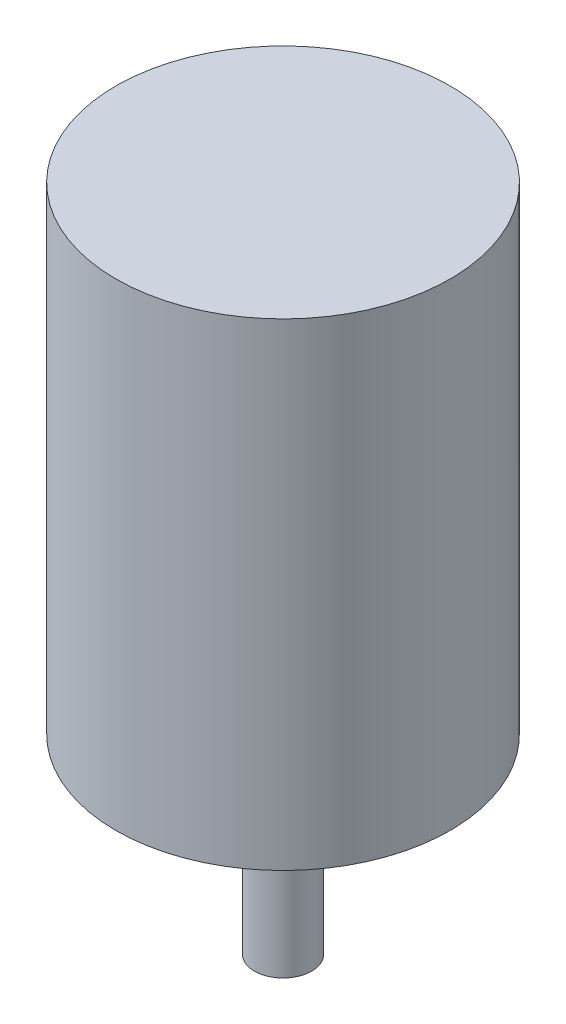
from build123d import *

# Parameters (mm, degrees)
CROQUIS2_R              = 87.5
SALIENTE_EXTRUIR1_DEPTH = 250
CROQUIS3_R              = 15
SALIENTE_EXTRUIR2_DEPTH = 100


with BuildPart() as part:
    # Croquis2 → Saliente-Extruir1 (new body)
    with BuildSketch(Plane(origin=(0, 0, 0), x_dir=(1, 0, 0), z_dir=(0, 1, 0))):
        with Locations(Location((0, 0, 0), (0, 0, 270))):
            Circle(CROQUIS2_R)
    extrude(amount=-SALIENTE_EXTRUIR1_DEPTH)

    # Croquis3 → Saliente-Extruir2 (add)
    with BuildSketch(Plane.XZ.offset(250)):
        with Locations(Location((0, 0, 0), (0, 0, 90))):
            Circle(CROQUIS3_R)
    extrude(amount=SALIENTE_EXTRUIR2_DEPTH)


solid = part.part
